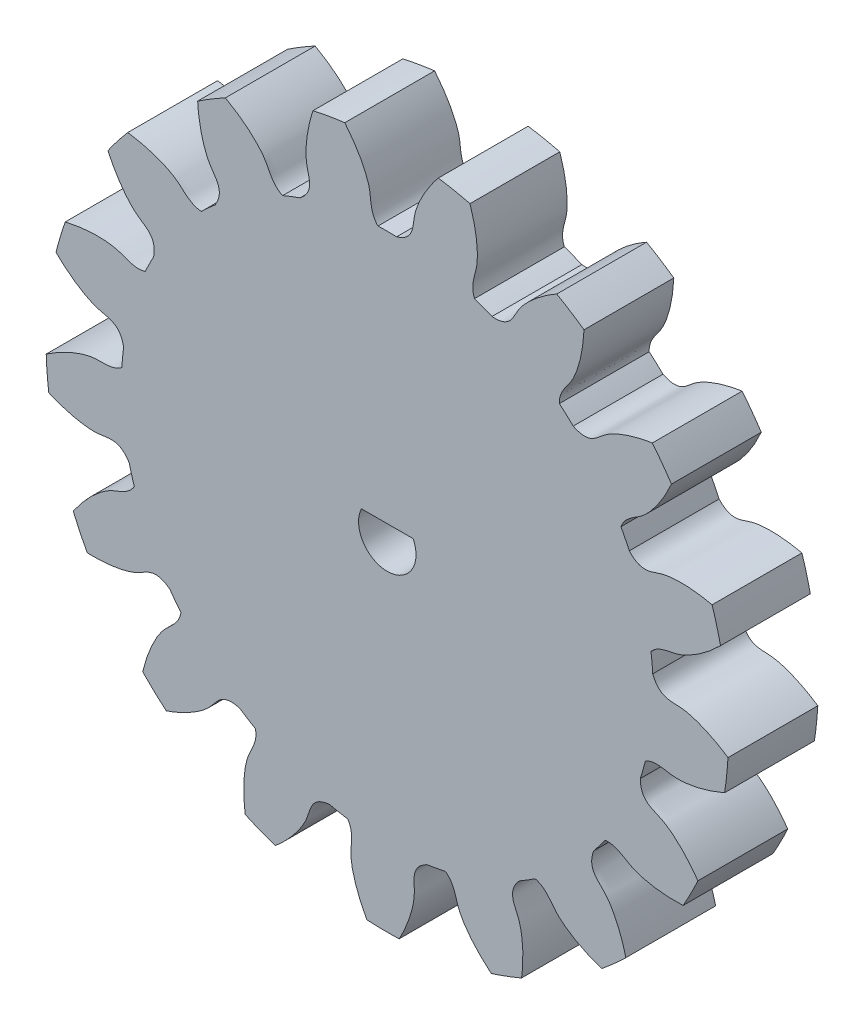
from build123d import *

# Parameters (mm, degrees)
SKETCH_1_R               = 19
EXTRUDE_1_DEPTH          = 30
CUT_EXTRUDE_1_DEPTH      = 41.274061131
PATTERN_CIRCULAR_1_COUNT = 17
CUT_EXTRUDE_2_DEPTH      = 41.269356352
CUT_EXTRUDE_2_DEPTH_BACK = 41.269356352
SKETCH_4_W               = 37.958446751
SKETCH_4_H               = 25
CUT_EXTRUDE_3_DEPTH      = 10


with BuildPart() as part:
    # Sketch 1 → Extrude 1 (new body)
    with BuildSketch(Plane.XY):
        Circle(SKETCH_1_R)
    extrude(amount=EXTRUDE_1_DEPTH)

    # Sketch 2 → Cut-Extrude 1 (cut, through all)
    with BuildSketch(Plane.XY):
        with BuildLine():
            ThreePointArc((0.520115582, 14.791909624), (0, 14.801050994), (-0.520115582, 14.791909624))
            add(Edge.make_bspline(
                [(-0.520115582, 14.791909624), (-0.972191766, 15.253585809), (-0.879271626, 15.855655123), (-1.012195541, 16.427170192), (-1.025536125, 16.479822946), (-1.041621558, 16.538360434), (-1.060685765, 16.602692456), (-1.08296813, 16.672720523), (-1.108702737, 16.748339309), (-1.138121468, 16.829436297), (-1.171452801, 16.915891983), (-1.208921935, 17.007579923), (-1.250750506, 17.104366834), (-1.297156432, 17.206112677), (-1.348353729, 17.312670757), (-1.404552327, 17.423887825), (-1.465957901, 17.539604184), (-1.532771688, 17.659653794), (-1.605190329, 17.783864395), (-1.683405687, 17.912057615), (-1.767604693, 18.044049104), (-1.857969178, 18.17964865), (-1.954675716, 18.318660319), (-2.057895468, 18.460882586), (-2.167794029, 18.606108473), (-2.284531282, 18.754125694), (-2.408261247, 18.9047168), (-2.539131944, 19.057659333), (-2.677285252, 19.212725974), (-2.822856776, 19.369684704), (-2.975975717, 19.528298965), (-3.136764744, 19.688327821), (-3.305339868, 19.849526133), (-3.481810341, 20.011644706), (-3.666278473, 20.174430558), (-3.858839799, 20.337626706), (-4.059581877, 20.500973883), (-4.26858845, 20.664204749), (-4.485922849, 20.827067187), (-4.711691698, 20.989235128), (-4.945798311, 21.150654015), (-5.188894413, 21.310207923), (-5.551664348, 21.543505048), (-5.851937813, 21.696525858), (-6.00139186, 21.889941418)],
                knots=[0, 0, 0, 0, 0.178934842, 0.184107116, 0.189969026, 0.196520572, 0.203761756, 0.211692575, 0.220313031, 0.229623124, 0.239622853, 0.250312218, 0.26169122, 0.273759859, 0.286518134, 0.299966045, 0.314103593, 0.328930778, 0.344447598, 0.360654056, 0.37755015, 0.39513588, 0.413411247, 0.43237625, 0.45203089, 0.472375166, 0.493409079, 0.515132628, 0.537545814, 0.560648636, 0.584441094, 0.60892319, 0.634094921, 0.659956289, 0.686507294, 0.713747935, 0.741678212, 0.770298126, 0.799607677, 0.829606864, 0.860295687, 0.891674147, 0.923742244, 1, 1, 1, 1], degree=3))
            ThreePointArc((-6.00139186, 21.889941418), (0.252713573, 22.696307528), (6.487313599, 21.750885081))
            add(Edge.make_bspline(
                [(0.520115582, 14.791909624), (1.530874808, 15.092850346), (1.391069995, 15.782497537), (1.541026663, 16.427170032), (1.554366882, 16.479822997), (1.570452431, 16.538360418), (1.589516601, 16.602692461), (1.611798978, 16.672720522), (1.637533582, 16.74833931), (1.666952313, 16.829436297), (1.700283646, 16.915891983), (1.73775278, 17.007579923), (1.779581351, 17.104366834), (1.825987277, 17.206112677), (1.877184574, 17.312670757), (1.933383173, 17.423887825), (1.994788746, 17.539604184), (2.061602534, 17.659653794), (2.134021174, 17.783864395), (2.212236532, 17.912057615), (2.296435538, 18.044049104), (2.386800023, 18.17964865), (2.483506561, 18.318660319), (2.586726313, 18.460882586), (2.696624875, 18.606108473), (2.813362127, 18.754125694), (2.937092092, 18.9047168), (3.067962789, 19.057659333), (3.206116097, 19.212725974), (3.351687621, 19.369684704), (3.504806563, 19.528298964), (3.665595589, 19.688327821), (3.834170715, 19.84952613), (4.010641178, 20.011644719), (4.19510935, 20.174430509), (4.387670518, 20.337626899), (4.588413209, 20.500973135), (4.797417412, 20.664207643), (5.014760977, 20.827055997), (5.2404944, 20.989278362), (5.474737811, 21.150487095), (5.717306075, 21.310851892), (6.050895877, 21.519508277), (6.302899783, 21.676939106), (6.487313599, 21.750885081)],
                knots=[0, 0, 0, 0, 0.200836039, 0.205946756, 0.211738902, 0.218212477, 0.225367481, 0.233203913, 0.241721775, 0.250921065, 0.260801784, 0.271363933, 0.28260751, 0.294532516, 0.307138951, 0.320426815, 0.334396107, 0.349046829, 0.36437898, 0.380392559, 0.397087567, 0.414464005, 0.432521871, 0.451261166, 0.47068189, 0.490784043, 0.511567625, 0.533032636, 0.555179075, 0.578006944, 0.601516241, 0.625706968, 0.650579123, 0.676132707, 0.702367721, 0.729284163, 0.756882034, 0.785161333, 0.814122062, 0.84376422, 0.874087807, 0.905092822, 0.936779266, 1, 1, 1, 1], degree=3))
        make_face()
    cut_extrude_1 = extrude(amount=CUT_EXTRUDE_1_DEPTH, mode=Mode.SUBTRACT)

    # Pattern Circular 1: Cut-Extrude 1 ×17 about axis
    pattern_circular_1_axis = Axis((0, 0, -1.5), (0, 0, 1))
    for i in range(1, PATTERN_CIRCULAR_1_COUNT):
        add(cut_extrude_1.rotate(pattern_circular_1_axis, i * 360 / PATTERN_CIRCULAR_1_COUNT), mode=Mode.SUBTRACT)

    # Sketch 4 → Cut-Extrude 2 (cut, two sides: drawn at the far end of the back side and taken through both)
    with BuildSketch(Plane(origin=(0, 0, 0), x_dir=(1, 0, 0), z_dir=(0, 1, 0)).offset(-CUT_EXTRUDE_2_DEPTH_BACK)):
        with Locations((-0.010793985, -17.5)):
            Rectangle(SKETCH_4_W, SKETCH_4_H)
    extrude(amount=CUT_EXTRUDE_2_DEPTH + CUT_EXTRUDE_2_DEPTH_BACK, mode=Mode.SUBTRACT)

    # Sketch 5 → Cut-Extrude 3 (cut)
    with BuildSketch(Plane.XY.offset(5)):
        with BuildLine():
            Line((1.438749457, 0.7), (-1.438749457, 0.7))
            ThreePointArc((-1.438749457, 0.7), (0, -1.6), (1.438749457, 0.7))
        make_face()
    extrude(amount=-CUT_EXTRUDE_3_DEPTH, mode=Mode.SUBTRACT)


solid = part.part
